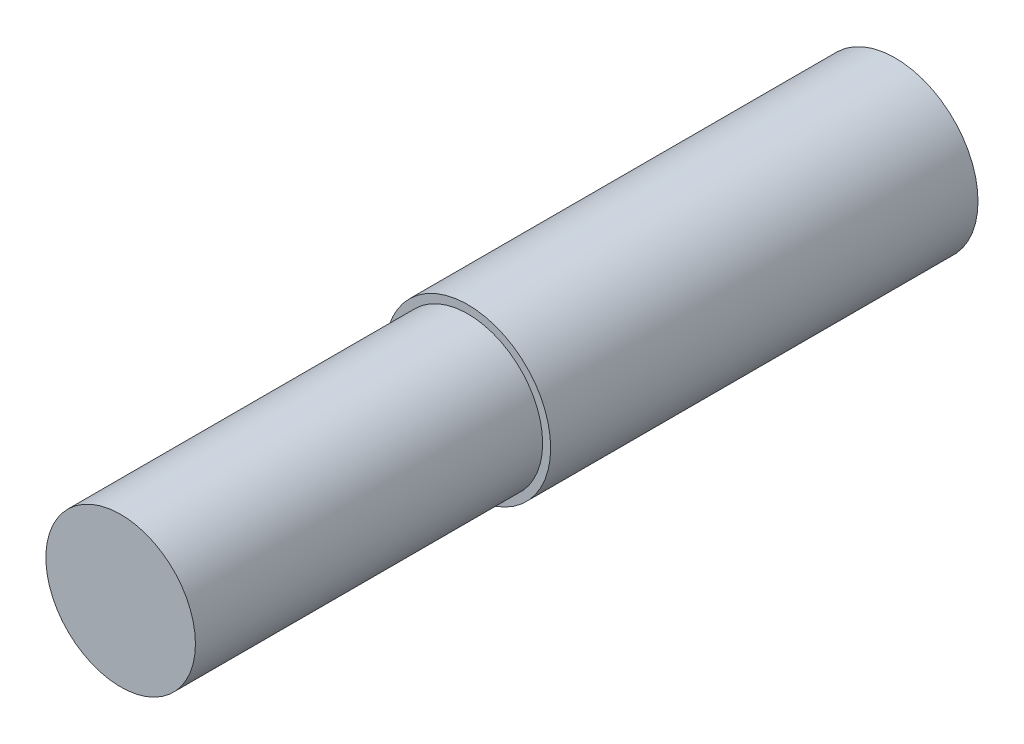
from build123d import *

# Parameters (mm, degrees)
SKETCH1_R           = 15.5
BOSS_EXTRUDE1_DEPTH = 80
SKETCH2_R           = 14
BOSS_EXTRUDE2_DEPTH = 65


with BuildPart() as part:
    # Sketch1 → Boss-Extrude1 (new body)
    with BuildSketch(Plane.XY):
        Circle(SKETCH1_R)
    extrude(amount=BOSS_EXTRUDE1_DEPTH)

    # Sketch2 → Boss-Extrude2 (add)
    with BuildSketch(Plane.XY.offset(80)):
        Circle(SKETCH2_R)
    extrude(amount=BOSS_EXTRUDE2_DEPTH)


solid = part.part
